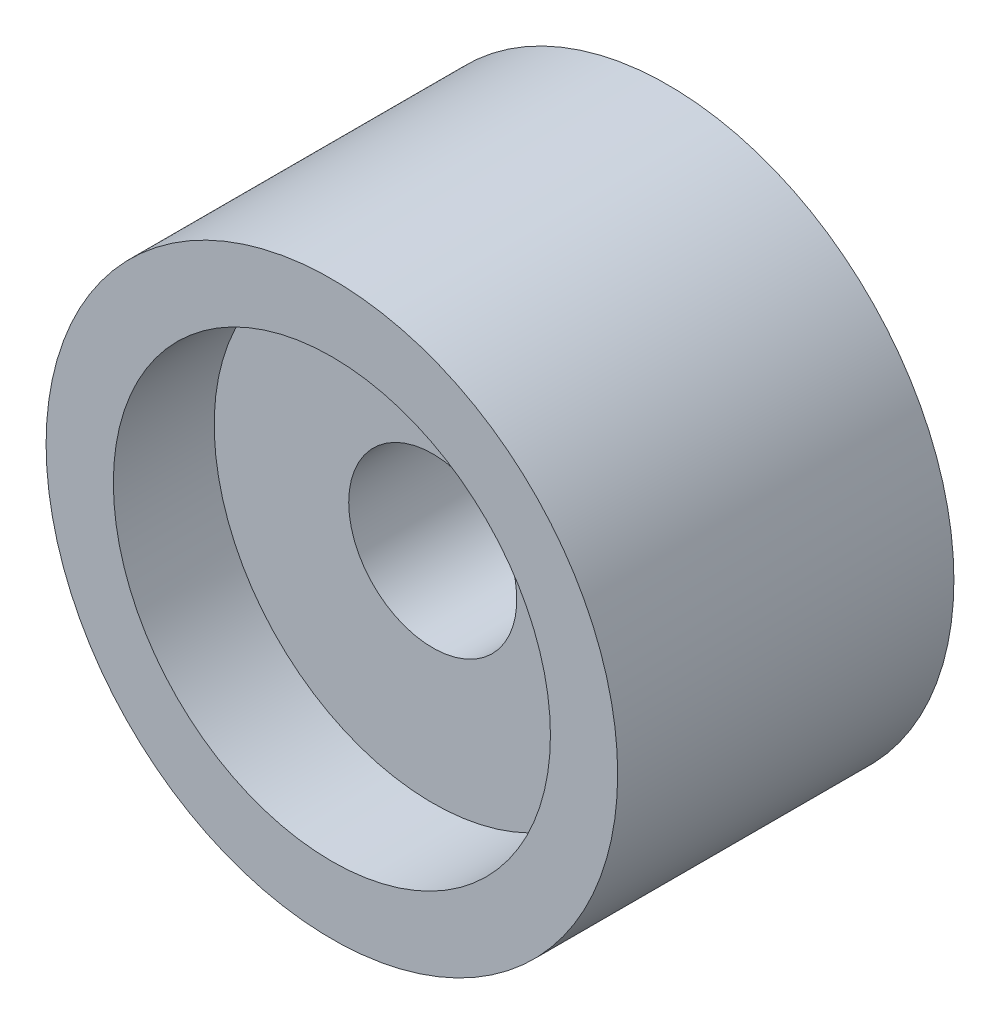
ISO-10303-21;
HEADER;
FILE_DESCRIPTION(('STEP AP214'),'2;1');
FILE_NAME('part.step','',(''),(''),'','','');
FILE_SCHEMA(('AUTOMOTIVE_DESIGN { 1 0 10303 214 1 1 1 1 }'));
ENDSEC;
DATA;
#1=APPLICATION_CONTEXT('core data for automotive mechanical design processes');
#2=APPLICATION_PROTOCOL_DEFINITION('international standard','automotive_design',2000,#1);
#3=PRODUCT_CONTEXT('',#1,'mechanical');
#4=PRODUCT('Part','Part','',(#3));
#5=PRODUCT_RELATED_PRODUCT_CATEGORY('part','',(#4));
#6=PRODUCT_DEFINITION_FORMATION('','',#4);
#7=PRODUCT_DEFINITION_CONTEXT('part definition',#1,'design');
#8=PRODUCT_DEFINITION('design','',#6,#7);
#9=PRODUCT_DEFINITION_SHAPE('','',#8);
#10=(LENGTH_UNIT() NAMED_UNIT(*) SI_UNIT(.MILLI.,.METRE.));
#11=(NAMED_UNIT(*) PLANE_ANGLE_UNIT() SI_UNIT($,.RADIAN.));
#12=(NAMED_UNIT(*) SI_UNIT($,.STERADIAN.) SOLID_ANGLE_UNIT());
#13=UNCERTAINTY_MEASURE_WITH_UNIT(LENGTH_MEASURE(1.E-05),#10,'distance_accuracy_value','');
#14=(GEOMETRIC_REPRESENTATION_CONTEXT(3) GLOBAL_UNCERTAINTY_ASSIGNED_CONTEXT((#13)) GLOBAL_UNIT_ASSIGNED_CONTEXT((#10,
#11,#12)) REPRESENTATION_CONTEXT('',''));
#15=CARTESIAN_POINT('',(0.,0.,0.));
#16=DIRECTION('',(0.,0.,1.));
#17=DIRECTION('',(1.,0.,0.));
#18=AXIS2_PLACEMENT_3D('',#15,#16,#17);
#19=CARTESIAN_POINT('',(0.,-19.5,-10.));
#20=DIRECTION('',(0.,0.,1.));
#21=DIRECTION('',(0.,1.,0.));
#22=AXIS2_PLACEMENT_3D('',#19,#20,#21);
#23=PLANE('',#22);
#24=CARTESIAN_POINT('',(0.,0.,-10.0000000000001));
#25=DIRECTION('',(0.,0.,1.));
#26=DIRECTION('',(0.,1.,0.));
#27=AXIS2_PLACEMENT_3D('',#24,#25,#26);
#28=CIRCLE('',#27,11.);
#29=CARTESIAN_POINT('',(0.,11.,-10.0000000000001));
#30=VERTEX_POINT('',#29);
#31=EDGE_CURVE('E19',#30,#30,#28,.T.);
#32=ORIENTED_EDGE('',*,*,#31,.T.);
#33=EDGE_LOOP('',(#32));
#34=FACE_BOUND('',#33,.T.);
#35=CARTESIAN_POINT('',(0.,0.,-10.));
#36=DIRECTION('',(0.,0.,1.));
#37=DIRECTION('',(1.,0.,0.));
#38=AXIS2_PLACEMENT_3D('',#35,#36,#37);
#39=CIRCLE('',#38,17.);
#40=CARTESIAN_POINT('',(17.,0.,-10.));
#41=VERTEX_POINT('',#40);
#42=EDGE_CURVE('E38',#41,#41,#39,.T.);
#43=ORIENTED_EDGE('',*,*,#42,.F.);
#44=EDGE_LOOP('',(#43));
#45=FACE_BOUND('',#44,.T.);
#46=ADVANCED_FACE('F12',(#34,#45),#23,.F.);
#47=CARTESIAN_POINT('',(0.,-19.5,10.));
#48=DIRECTION('',(0.,0.,-1.));
#49=DIRECTION('',(0.,-1.,0.));
#50=AXIS2_PLACEMENT_3D('',#47,#48,#49);
#51=PLANE('',#50);
#52=CARTESIAN_POINT('',(0.,0.,10.));
#53=DIRECTION('',(0.,0.,-1.));
#54=DIRECTION('',(-1.,0.,0.));
#55=AXIS2_PLACEMENT_3D('',#52,#53,#54);
#56=CIRCLE('',#55,13.);
#57=CARTESIAN_POINT('',(-13.,0.,10.));
#58=VERTEX_POINT('',#57);
#59=EDGE_CURVE('E35',#58,#58,#56,.T.);
#60=ORIENTED_EDGE('',*,*,#59,.T.);
#61=EDGE_LOOP('',(#60));
#62=FACE_BOUND('',#61,.T.);
#63=CARTESIAN_POINT('',(0.,0.,10.));
#64=DIRECTION('',(0.,0.,1.));
#65=DIRECTION('',(1.,0.,0.));
#66=AXIS2_PLACEMENT_3D('',#63,#64,#65);
#67=CIRCLE('',#66,17.);
#68=CARTESIAN_POINT('',(17.,0.,10.));
#69=VERTEX_POINT('',#68);
#70=EDGE_CURVE('E39',#69,#69,#67,.T.);
#71=ORIENTED_EDGE('',*,*,#70,.T.);
#72=EDGE_LOOP('',(#71));
#73=FACE_BOUND('',#72,.T.);
#74=ADVANCED_FACE('F49',(#62,#73),#51,.F.);
#75=CARTESIAN_POINT('',(0.,-11.3718951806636,4.));
#76=DIRECTION('',(0.,0.,-1.));
#77=DIRECTION('',(0.,-1.,0.));
#78=AXIS2_PLACEMENT_3D('',#75,#76,#77);
#79=PLANE('',#78);
#80=CARTESIAN_POINT('',(0.,0.,4.));
#81=DIRECTION('',(0.,0.,1.));
#82=DIRECTION('',(1.,0.,0.));
#83=AXIS2_PLACEMENT_3D('',#80,#81,#82);
#84=CIRCLE('',#83,13.);
#85=CARTESIAN_POINT('',(13.,0.,4.));
#86=VERTEX_POINT('',#85);
#87=EDGE_CURVE('E23',#86,#86,#84,.T.);
#88=ORIENTED_EDGE('',*,*,#87,.T.);
#89=EDGE_LOOP('',(#88));
#90=FACE_BOUND('',#89,.T.);
#91=CARTESIAN_POINT('',(0.,0.,4.));
#92=DIRECTION('',(0.,0.,-1.));
#93=DIRECTION('',(-1.,0.,0.));
#94=AXIS2_PLACEMENT_3D('',#91,#92,#93);
#95=CIRCLE('',#94,5.);
#96=CARTESIAN_POINT('',(-5.,0.,4.));
#97=VERTEX_POINT('',#96);
#98=EDGE_CURVE('E32',#97,#97,#95,.T.);
#99=ORIENTED_EDGE('',*,*,#98,.T.);
#100=EDGE_LOOP('',(#99));
#101=FACE_BOUND('',#100,.T.);
#102=ADVANCED_FACE('F14',(#90,#101),#79,.F.);
#103=CARTESIAN_POINT('',(0.,-11.,-4.));
#104=DIRECTION('',(0.,0.,1.));
#105=DIRECTION('',(0.,1.,0.));
#106=AXIS2_PLACEMENT_3D('',#103,#104,#105);
#107=PLANE('',#106);
#108=CARTESIAN_POINT('',(0.,0.,-4.));
#109=DIRECTION('',(0.,0.,1.));
#110=DIRECTION('',(0.,1.,0.));
#111=AXIS2_PLACEMENT_3D('',#108,#109,#110);
#112=CIRCLE('',#111,11.);
#113=CARTESIAN_POINT('',(0.,11.,-4.));
#114=VERTEX_POINT('',#113);
#115=EDGE_CURVE('E8',#114,#114,#112,.T.);
#116=ORIENTED_EDGE('',*,*,#115,.F.);
#117=EDGE_LOOP('',(#116));
#118=FACE_BOUND('',#117,.T.);
#119=CARTESIAN_POINT('',(0.,0.,-4.));
#120=DIRECTION('',(0.,0.,-1.));
#121=DIRECTION('',(-1.,0.,0.));
#122=AXIS2_PLACEMENT_3D('',#119,#120,#121);
#123=CIRCLE('',#122,5.);
#124=CARTESIAN_POINT('',(-5.,0.,-4.));
#125=VERTEX_POINT('',#124);
#126=EDGE_CURVE('E27',#125,#125,#123,.T.);
#127=ORIENTED_EDGE('',*,*,#126,.F.);
#128=EDGE_LOOP('',(#127));
#129=FACE_BOUND('',#128,.T.);
#130=ADVANCED_FACE('F64',(#118,#129),#107,.F.);
#131=CARTESIAN_POINT('',(0.,0.,17.));
#132=DIRECTION('',(0.,0.,1.));
#133=DIRECTION('',(0.,1.,0.));
#134=AXIS2_PLACEMENT_3D('',#131,#132,#133);
#135=CYLINDRICAL_SURFACE('',#134,11.);
#136=ORIENTED_EDGE('',*,*,#31,.F.);
#137=EDGE_LOOP('',(#136));
#138=FACE_BOUND('',#137,.T.);
#139=ORIENTED_EDGE('',*,*,#115,.T.);
#140=EDGE_LOOP('',(#139));
#141=FACE_BOUND('',#140,.T.);
#142=ADVANCED_FACE('F60',(#138,#141),#135,.F.);
#143=CARTESIAN_POINT('',(0.,0.,17.));
#144=DIRECTION('',(0.,0.,1.));
#145=DIRECTION('',(0.,1.,0.));
#146=AXIS2_PLACEMENT_3D('',#143,#144,#145);
#147=CYLINDRICAL_SURFACE('',#146,13.);
#148=ORIENTED_EDGE('',*,*,#87,.F.);
#149=EDGE_LOOP('',(#148));
#150=FACE_BOUND('',#149,.T.);
#151=ORIENTED_EDGE('',*,*,#59,.F.);
#152=EDGE_LOOP('',(#151));
#153=FACE_BOUND('',#152,.T.);
#154=ADVANCED_FACE('F63',(#150,#153),#147,.F.);
#155=CARTESIAN_POINT('',(0.,0.,17.));
#156=DIRECTION('',(0.,0.,1.));
#157=DIRECTION('',(0.,1.,0.));
#158=AXIS2_PLACEMENT_3D('',#155,#156,#157);
#159=CYLINDRICAL_SURFACE('',#158,5.);
#160=ORIENTED_EDGE('',*,*,#126,.T.);
#161=EDGE_LOOP('',(#160));
#162=FACE_BOUND('',#161,.T.);
#163=ORIENTED_EDGE('',*,*,#98,.F.);
#164=EDGE_LOOP('',(#163));
#165=FACE_BOUND('',#164,.T.);
#166=ADVANCED_FACE('F68',(#162,#165),#159,.F.);
#167=CARTESIAN_POINT('',(0.,0.,-10.));
#168=DIRECTION('',(0.,0.,1.));
#169=DIRECTION('',(1.,0.,0.));
#170=AXIS2_PLACEMENT_3D('',#167,#168,#169);
#171=CYLINDRICAL_SURFACE('',#170,17.);
#172=ORIENTED_EDGE('',*,*,#42,.T.);
#173=EDGE_LOOP('',(#172));
#174=FACE_BOUND('',#173,.T.);
#175=ORIENTED_EDGE('',*,*,#70,.F.);
#176=EDGE_LOOP('',(#175));
#177=FACE_BOUND('',#176,.T.);
#178=ADVANCED_FACE('F45',(#174,#177),#171,.T.);
#179=CLOSED_SHELL('',(#46,#74,#102,#130,#142,#154,#166,#178));
#180=MANIFOLD_SOLID_BREP('B1',#179);
#181=ADVANCED_BREP_SHAPE_REPRESENTATION('',(#18,#180),#14);
#182=SHAPE_DEFINITION_REPRESENTATION(#9,#181);
ENDSEC;
END-ISO-10303-21;
